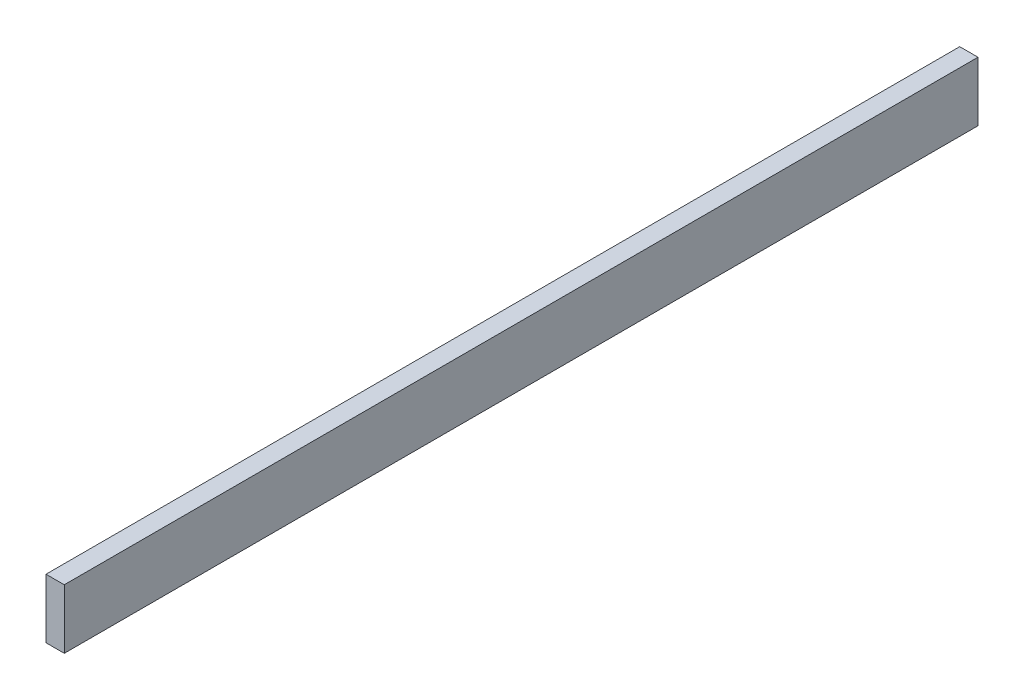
ISO-10303-21;
HEADER;
FILE_DESCRIPTION(('STEP AP214'),'2;1');
FILE_NAME('part.step','',(''),(''),'','','');
FILE_SCHEMA(('AUTOMOTIVE_DESIGN { 1 0 10303 214 1 1 1 1 }'));
ENDSEC;
DATA;
#1=APPLICATION_CONTEXT('core data for automotive mechanical design processes');
#2=APPLICATION_PROTOCOL_DEFINITION('international standard','automotive_design',2000,#1);
#3=PRODUCT_CONTEXT('',#1,'mechanical');
#4=PRODUCT('Part','Part','',(#3));
#5=PRODUCT_RELATED_PRODUCT_CATEGORY('part','',(#4));
#6=PRODUCT_DEFINITION_FORMATION('','',#4);
#7=PRODUCT_DEFINITION_CONTEXT('part definition',#1,'design');
#8=PRODUCT_DEFINITION('design','',#6,#7);
#9=PRODUCT_DEFINITION_SHAPE('','',#8);
#10=(LENGTH_UNIT() NAMED_UNIT(*) SI_UNIT(.MILLI.,.METRE.));
#11=(NAMED_UNIT(*) PLANE_ANGLE_UNIT() SI_UNIT($,.RADIAN.));
#12=(NAMED_UNIT(*) SI_UNIT($,.STERADIAN.) SOLID_ANGLE_UNIT());
#13=UNCERTAINTY_MEASURE_WITH_UNIT(LENGTH_MEASURE(1.E-05),#10,'distance_accuracy_value','');
#14=(GEOMETRIC_REPRESENTATION_CONTEXT(3) GLOBAL_UNCERTAINTY_ASSIGNED_CONTEXT((#13)) GLOBAL_UNIT_ASSIGNED_CONTEXT((#10,
#11,#12)) REPRESENTATION_CONTEXT('',''));
#15=CARTESIAN_POINT('',(0.,0.,0.));
#16=DIRECTION('',(0.,0.,1.));
#17=DIRECTION('',(1.,0.,0.));
#18=AXIS2_PLACEMENT_3D('',#15,#16,#17);
#19=CARTESIAN_POINT('',(-2.,6.5,100.));
#20=DIRECTION('',(1.,0.,0.));
#21=DIRECTION('',(0.,0.,-1.));
#22=AXIS2_PLACEMENT_3D('',#19,#20,#21);
#23=PLANE('',#22);
#24=DIRECTION('',(0.,-1.,0.));
#25=VECTOR('',#24,1.);
#26=CARTESIAN_POINT('',(-2.,6.5,-100.));
#27=LINE('',#26,#25);
#28=CARTESIAN_POINT('',(-2.,6.5,-100.));
#29=VERTEX_POINT('',#28);
#30=CARTESIAN_POINT('',(-2.,-6.5,-100.));
#31=VERTEX_POINT('',#30);
#32=EDGE_CURVE('E70',#29,#31,#27,.T.);
#33=ORIENTED_EDGE('',*,*,#32,.T.);
#34=DIRECTION('',(0.,0.,-1.));
#35=VECTOR('',#34,1.);
#36=CARTESIAN_POINT('',(-2.,-6.5,100.));
#37=LINE('',#36,#35);
#38=CARTESIAN_POINT('',(-2.,-6.5,100.));
#39=VERTEX_POINT('',#38);
#40=EDGE_CURVE('E11',#39,#31,#37,.T.);
#41=ORIENTED_EDGE('',*,*,#40,.F.);
#42=DIRECTION('',(0.,-1.,0.));
#43=VECTOR('',#42,1.);
#44=CARTESIAN_POINT('',(-2.,6.5,100.));
#45=LINE('',#44,#43);
#46=CARTESIAN_POINT('',(-2.,6.5,100.));
#47=VERTEX_POINT('',#46);
#48=EDGE_CURVE('E88',#47,#39,#45,.T.);
#49=ORIENTED_EDGE('',*,*,#48,.F.);
#50=DIRECTION('',(0.,0.,-1.));
#51=VECTOR('',#50,1.);
#52=CARTESIAN_POINT('',(-2.,6.5,100.));
#53=LINE('',#52,#51);
#54=EDGE_CURVE('E82',#47,#29,#53,.T.);
#55=ORIENTED_EDGE('',*,*,#54,.T.);
#56=EDGE_LOOP('',(#33,#41,#49,#55));
#57=FACE_BOUND('',#56,.T.);
#58=ADVANCED_FACE('F26',(#57),#23,.F.);
#59=CARTESIAN_POINT('',(-2.,-6.5,100.));
#60=DIRECTION('',(0.,1.,0.));
#61=DIRECTION('',(0.,0.,1.));
#62=AXIS2_PLACEMENT_3D('',#59,#60,#61);
#63=PLANE('',#62);
#64=DIRECTION('',(1.,0.,0.));
#65=VECTOR('',#64,1.);
#66=CARTESIAN_POINT('',(-2.,-6.5,-100.));
#67=LINE('',#66,#65);
#68=CARTESIAN_POINT('',(2.,-6.5,-100.));
#69=VERTEX_POINT('',#68);
#70=EDGE_CURVE('E66',#31,#69,#67,.T.);
#71=ORIENTED_EDGE('',*,*,#70,.T.);
#72=DIRECTION('',(0.,0.,-1.));
#73=VECTOR('',#72,1.);
#74=CARTESIAN_POINT('',(2.,-6.5,100.));
#75=LINE('',#74,#73);
#76=CARTESIAN_POINT('',(2.,-6.5,100.));
#77=VERTEX_POINT('',#76);
#78=EDGE_CURVE('E33',#77,#69,#75,.T.);
#79=ORIENTED_EDGE('',*,*,#78,.F.);
#80=DIRECTION('',(1.,0.,0.));
#81=VECTOR('',#80,1.);
#82=CARTESIAN_POINT('',(-2.,-6.5,100.));
#83=LINE('',#82,#81);
#84=EDGE_CURVE('E78',#39,#77,#83,.T.);
#85=ORIENTED_EDGE('',*,*,#84,.F.);
#86=ORIENTED_EDGE('',*,*,#40,.T.);
#87=EDGE_LOOP('',(#71,#79,#85,#86));
#88=FACE_BOUND('',#87,.T.);
#89=ADVANCED_FACE('F77',(#88),#63,.F.);
#90=CARTESIAN_POINT('',(2.,6.5,100.));
#91=DIRECTION('',(-1.,0.,0.));
#92=DIRECTION('',(0.,0.,1.));
#93=AXIS2_PLACEMENT_3D('',#90,#91,#92);
#94=PLANE('',#93);
#95=DIRECTION('',(0.,1.,0.));
#96=VECTOR('',#95,1.);
#97=CARTESIAN_POINT('',(2.,6.5,-100.));
#98=LINE('',#97,#96);
#99=CARTESIAN_POINT('',(2.,6.5,-100.));
#100=VERTEX_POINT('',#99);
#101=EDGE_CURVE('E71',#69,#100,#98,.T.);
#102=ORIENTED_EDGE('',*,*,#101,.T.);
#103=DIRECTION('',(0.,0.,-1.));
#104=VECTOR('',#103,1.);
#105=CARTESIAN_POINT('',(2.,6.5,100.));
#106=LINE('',#105,#104);
#107=CARTESIAN_POINT('',(2.,6.5,100.));
#108=VERTEX_POINT('',#107);
#109=EDGE_CURVE('E94',#108,#100,#106,.T.);
#110=ORIENTED_EDGE('',*,*,#109,.F.);
#111=DIRECTION('',(0.,1.,0.));
#112=VECTOR('',#111,1.);
#113=CARTESIAN_POINT('',(2.,6.5,100.));
#114=LINE('',#113,#112);
#115=EDGE_CURVE('E45',#77,#108,#114,.T.);
#116=ORIENTED_EDGE('',*,*,#115,.F.);
#117=ORIENTED_EDGE('',*,*,#78,.T.);
#118=EDGE_LOOP('',(#102,#110,#116,#117));
#119=FACE_BOUND('',#118,.T.);
#120=ADVANCED_FACE('F97',(#119),#94,.F.);
#121=CARTESIAN_POINT('',(-2.,6.5,100.));
#122=DIRECTION('',(0.,-1.,0.));
#123=DIRECTION('',(0.,0.,-1.));
#124=AXIS2_PLACEMENT_3D('',#121,#122,#123);
#125=PLANE('',#124);
#126=DIRECTION('',(-1.,0.,0.));
#127=VECTOR('',#126,1.);
#128=CARTESIAN_POINT('',(-2.,6.5,-100.));
#129=LINE('',#128,#127);
#130=EDGE_CURVE('E86',#100,#29,#129,.T.);
#131=ORIENTED_EDGE('',*,*,#130,.T.);
#132=ORIENTED_EDGE('',*,*,#54,.F.);
#133=DIRECTION('',(-1.,0.,0.));
#134=VECTOR('',#133,1.);
#135=CARTESIAN_POINT('',(-2.,6.5,100.));
#136=LINE('',#135,#134);
#137=EDGE_CURVE('E40',#108,#47,#136,.T.);
#138=ORIENTED_EDGE('',*,*,#137,.F.);
#139=ORIENTED_EDGE('',*,*,#109,.T.);
#140=EDGE_LOOP('',(#131,#132,#138,#139));
#141=FACE_BOUND('',#140,.T.);
#142=ADVANCED_FACE('F99',(#141),#125,.F.);
#143=CARTESIAN_POINT('',(-2.,-6.5,100.));
#144=DIRECTION('',(0.,0.,1.));
#145=DIRECTION('',(1.,0.,0.));
#146=AXIS2_PLACEMENT_3D('',#143,#144,#145);
#147=PLANE('',#146);
#148=ORIENTED_EDGE('',*,*,#48,.T.);
#149=ORIENTED_EDGE('',*,*,#84,.T.);
#150=ORIENTED_EDGE('',*,*,#115,.T.);
#151=ORIENTED_EDGE('',*,*,#137,.T.);
#152=EDGE_LOOP('',(#148,#149,#150,#151));
#153=FACE_BOUND('',#152,.T.);
#154=ADVANCED_FACE('F100',(#153),#147,.T.);
#155=CARTESIAN_POINT('',(-2.,-6.5,-100.));
#156=DIRECTION('',(0.,0.,1.));
#157=DIRECTION('',(1.,0.,0.));
#158=AXIS2_PLACEMENT_3D('',#155,#156,#157);
#159=PLANE('',#158);
#160=ORIENTED_EDGE('',*,*,#32,.F.);
#161=ORIENTED_EDGE('',*,*,#130,.F.);
#162=ORIENTED_EDGE('',*,*,#101,.F.);
#163=ORIENTED_EDGE('',*,*,#70,.F.);
#164=EDGE_LOOP('',(#160,#161,#162,#163));
#165=FACE_BOUND('',#164,.T.);
#166=ADVANCED_FACE('F67',(#165),#159,.F.);
#167=CLOSED_SHELL('',(#58,#89,#120,#142,#154,#166));
#168=MANIFOLD_SOLID_BREP('B2',#167);
#169=ADVANCED_BREP_SHAPE_REPRESENTATION('',(#18,#168),#14);
#170=SHAPE_DEFINITION_REPRESENTATION(#9,#169);
ENDSEC;
END-ISO-10303-21;
